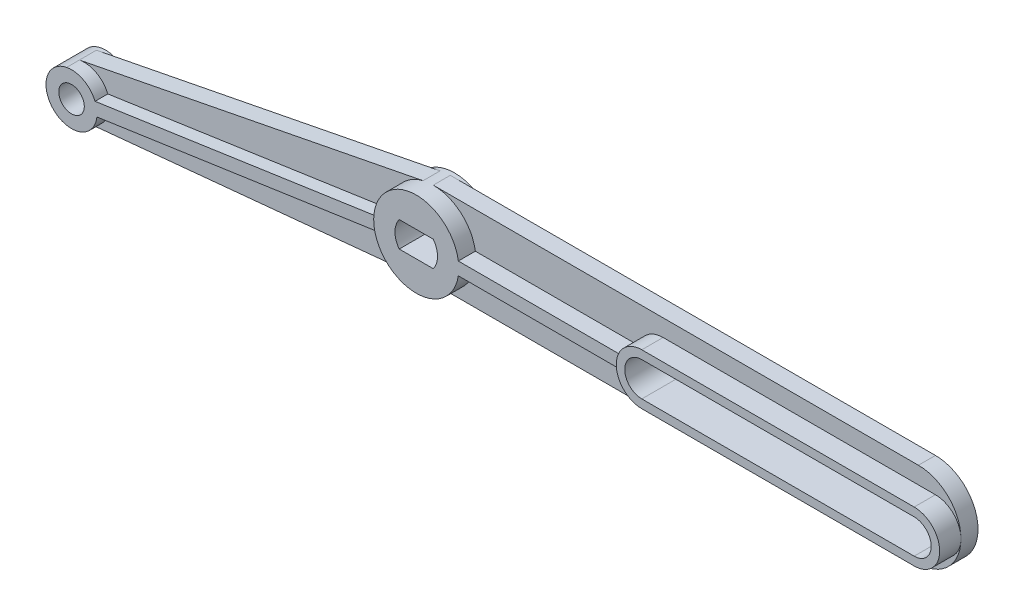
from build123d import *

# Parameters (mm, degrees)
EXTRUSION1_DEPTH        = 2
EXTRUSION2_DEPTH        = 2
EXTRUSION2_DEPTH_BACK   = 2.5
ESQUISSE3_R             = 5
EXTRUSION3_DEPTH        = 2
EXTRUSION4_DEPTH        = 1.5
EXTRUSION4_DEPTH_BACK   = 2.5
ESQUISSE5_R             = 3
EXTRUSION5_DEPTH        = 2.5
NERVURE2_REACH          = 64.777
ESQUISSE10_R            = 1.5
ENL_V_MAT_EXTRU_2_DEPTH = 63.811225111
ENL_V_MAT_EXTRU_3_DEPTH = 63.84902545
NERVURE3_REACH          = 64.811
ESQUISSE12_WALLS_W      = 146.622450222
ESQUISSE12_WALLS_H      = 1.5


with BuildPart() as part:
    # Esquisse2 → Extrusion1 (new body)
    with BuildSketch(Plane.XY):
        with BuildLine():
            Line((0, -5), (57, -5))
            ThreePointArc((57, -5), (62, 0), (57, 5))
            Line((57, 5), (0, 5))
            Line((0, 5), (0, -5))
        make_face()
    extrude(amount=EXTRUSION1_DEPTH)

    # Esquisse3 → Extrusion2 (add, two sides: drawn at the far end of the back side and taken through both)
    with BuildSketch(Plane.XY.offset(2).offset(-EXTRUSION2_DEPTH_BACK)):
        Circle(ESQUISSE3_R)
    extrude(amount=EXTRUSION2_DEPTH + EXTRUSION2_DEPTH_BACK)

    # Esquisse4 → Extrusion3 (add)
    with BuildSketch(Plane.XY):
        with BuildLine():
            Line((-0.723995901, 4.947305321), (-41.576752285, -3.0559625))
            ThreePointArc((-41.576752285, -3.0559625), (-43.943997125, -6.576958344), (-40.4228356, -8.943956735))
            Line((-40.4228356, -8.943956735), (0.723995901, -4.947305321))
            ThreePointArc((0.723995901, -4.947305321), (4.947305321, 0.723995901), (-0.723995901, 4.947305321))
        make_face()
    extrude(amount=EXTRUSION3_DEPTH)

    # Esquisse5 → Extrusion4 (add, two sides: drawn at the far end of the back side and taken through both)
    with BuildSketch(Plane.XY.offset(2).offset(-EXTRUSION4_DEPTH_BACK)):
        with Locations((-41, -6)):
            Circle(ESQUISSE5_R)
    extrude(amount=EXTRUSION4_DEPTH + EXTRUSION4_DEPTH_BACK)

    # Esquisse6 → Extrusion5 (add)
    with BuildSketch(Plane.XY.offset(2)):
        with BuildLine():
            Line((27, -3), (59, -3))
            ThreePointArc((59, -3), (62, 0), (59, 3))
            Line((59, 3), (27, 3))
            ThreePointArc((27, 3), (24, 0), (27, -3))
        make_face()
    extrude(amount=EXTRUSION5_DEPTH)

    # Esquisse9 walls → Nervure2 (add, up to next)
    with BuildSketch(Plane.XY.offset(3.5), mode=Mode.PRIVATE) as nervure2_sk1:
        Polygon((-103.996639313, -15.977008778), (63.213838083, 8.492817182), (62.996639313, 9.977008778), (-104.213838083, -14.492817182), align=None)
    nervure2_tool1 = extrude(nervure2_sk1.sketch, amount=-NERVURE2_REACH, mode=Mode.PRIVATE) - part.part
    add(nervure2_tool1.solids().sort_by_distance((-20.5, -3, 3.5))[0])

    # Esquisse10 → Enl_v. mat.-Extru.2 (cut, through all)
    with BuildSketch(Plane.XY.offset(4)):
        with Locations((-41, -6)):
            Circle(ESQUISSE10_R)
        with BuildLine():
            Line((-2, 1.5), (2, 1.5))
            ThreePointArc((2, 1.5), (2.5, 0), (2, -1.5))
            Line((2, -1.5), (-2, -1.5))
            ThreePointArc((-2, -1.5), (-2.5, 0), (-2, 1.5))
        make_face()
    extrude(amount=-ENL_V_MAT_EXTRU_2_DEPTH, mode=Mode.SUBTRACT)

    # Esquisse11 → Enl_v. mat.-Extru.3 (cut, through all)
    with BuildSketch(Plane.XY.offset(4.5)):
        with BuildLine():
            Line((27, 2), (59, 2))
            ThreePointArc((59, 2), (61, 0), (59, -2))
            Line((59, -2), (27, -2))
            ThreePointArc((27, -2), (25, 0), (27, 2))
        make_face()
    extrude(amount=-ENL_V_MAT_EXTRU_3_DEPTH, mode=Mode.SUBTRACT)

    # Esquisse12 walls → Nervure3 (add, up to next)
    with BuildSketch(Plane.XY.offset(4), mode=Mode.PRIVATE) as nervure3_sk1:
        with Locations((14.5, 0)):
            Rectangle(ESQUISSE12_WALLS_W, ESQUISSE12_WALLS_H)
    nervure3_tool1 = extrude(nervure3_sk1.sketch, amount=-NERVURE3_REACH, mode=Mode.PRIVATE) - part.part
    add(nervure3_tool1.solids().sort_by_distance((14.5, 0, 4))[0])


solid = part.part
